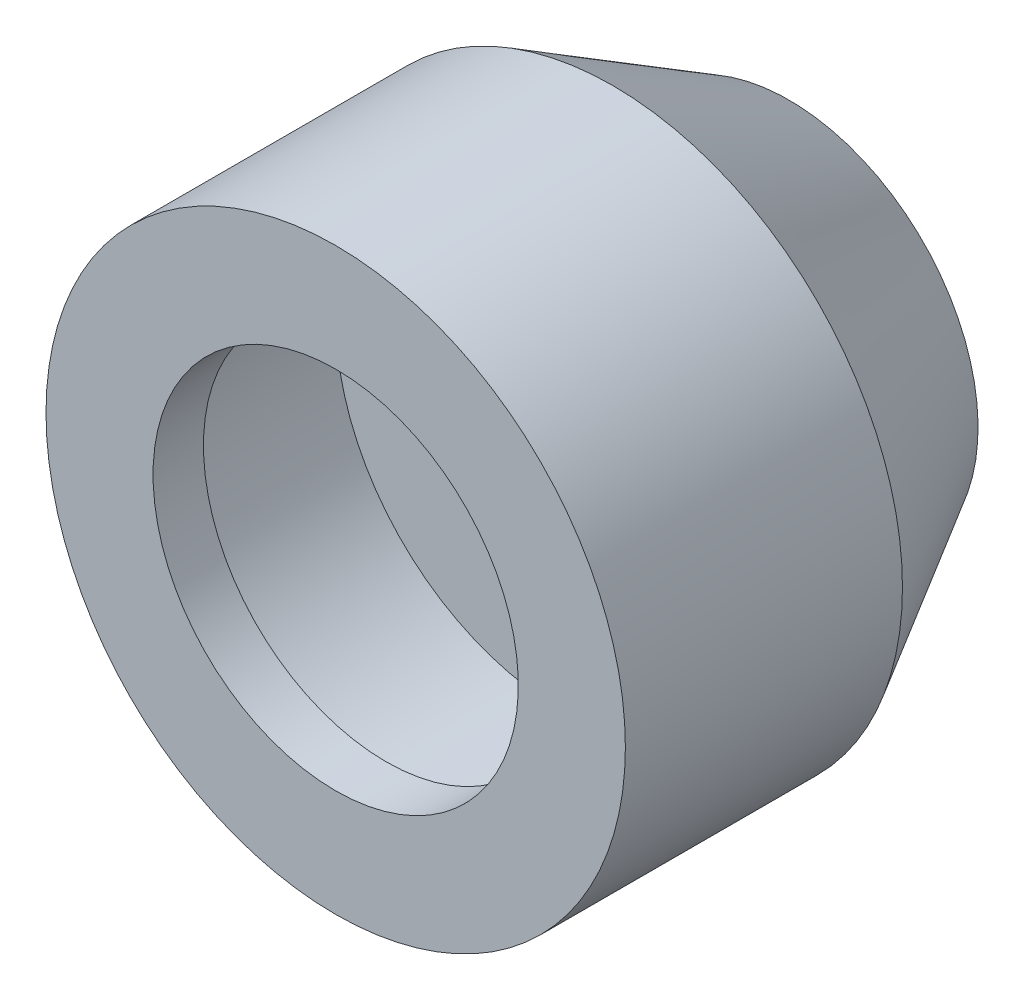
ISO-10303-21;
HEADER;
FILE_DESCRIPTION(('STEP AP214'),'2;1');
FILE_NAME('part.step','',(''),(''),'','','');
FILE_SCHEMA(('AUTOMOTIVE_DESIGN { 1 0 10303 214 1 1 1 1 }'));
ENDSEC;
DATA;
#1=APPLICATION_CONTEXT('core data for automotive mechanical design processes');
#2=APPLICATION_PROTOCOL_DEFINITION('international standard','automotive_design',2000,#1);
#3=PRODUCT_CONTEXT('',#1,'mechanical');
#4=PRODUCT('Part','Part','',(#3));
#5=PRODUCT_RELATED_PRODUCT_CATEGORY('part','',(#4));
#6=PRODUCT_DEFINITION_FORMATION('','',#4);
#7=PRODUCT_DEFINITION_CONTEXT('part definition',#1,'design');
#8=PRODUCT_DEFINITION('design','',#6,#7);
#9=PRODUCT_DEFINITION_SHAPE('','',#8);
#10=(LENGTH_UNIT() NAMED_UNIT(*) SI_UNIT(.MILLI.,.METRE.));
#11=(NAMED_UNIT(*) PLANE_ANGLE_UNIT() SI_UNIT($,.RADIAN.));
#12=(NAMED_UNIT(*) SI_UNIT($,.STERADIAN.) SOLID_ANGLE_UNIT());
#13=UNCERTAINTY_MEASURE_WITH_UNIT(LENGTH_MEASURE(1.E-05),#10,'distance_accuracy_value','');
#14=(GEOMETRIC_REPRESENTATION_CONTEXT(3) GLOBAL_UNCERTAINTY_ASSIGNED_CONTEXT((#13)) GLOBAL_UNIT_ASSIGNED_CONTEXT((#10,
#11,#12)) REPRESENTATION_CONTEXT('',''));
#15=CARTESIAN_POINT('',(0.,0.,0.));
#16=DIRECTION('',(0.,0.,1.));
#17=DIRECTION('',(1.,0.,0.));
#18=AXIS2_PLACEMENT_3D('',#15,#16,#17);
#19=CARTESIAN_POINT('',(0.,0.,9.));
#20=DIRECTION('',(0.,0.,1.));
#21=DIRECTION('',(0.,-1.,0.));
#22=AXIS2_PLACEMENT_3D('',#19,#20,#21);
#23=PLANE('',#22);
#24=CARTESIAN_POINT('',(0.,0.,9.));
#25=DIRECTION('',(0.,0.,1.));
#26=DIRECTION('',(0.,-1.,0.));
#27=AXIS2_PLACEMENT_3D('',#24,#25,#26);
#28=CIRCLE('',#27,9.);
#29=CARTESIAN_POINT('',(0.,-9.,9.));
#30=VERTEX_POINT('',#29);
#31=EDGE_CURVE('E8',#30,#30,#28,.T.);
#32=ORIENTED_EDGE('',*,*,#31,.T.);
#33=EDGE_LOOP('',(#32));
#34=FACE_BOUND('',#33,.T.);
#35=ADVANCED_FACE('F12',(#34),#23,.T.);
#36=CARTESIAN_POINT('',(0.,0.,0.));
#37=DIRECTION('',(0.,0.,1.));
#38=DIRECTION('',(0.,-1.,0.));
#39=AXIS2_PLACEMENT_3D('',#36,#37,#38);
#40=CYLINDRICAL_SURFACE('',#39,9.);
#41=CARTESIAN_POINT('',(0.,0.,16.));
#42=DIRECTION('',(0.,0.,1.));
#43=DIRECTION('',(0.,-1.,0.));
#44=AXIS2_PLACEMENT_3D('',#41,#42,#43);
#45=CIRCLE('',#44,9.);
#46=CARTESIAN_POINT('',(0.,-9.,16.));
#47=VERTEX_POINT('',#46);
#48=EDGE_CURVE('E18',#47,#47,#45,.T.);
#49=ORIENTED_EDGE('',*,*,#48,.T.);
#50=EDGE_LOOP('',(#49));
#51=FACE_BOUND('',#50,.T.);
#52=ORIENTED_EDGE('',*,*,#31,.F.);
#53=EDGE_LOOP('',(#52));
#54=FACE_BOUND('',#53,.T.);
#55=ADVANCED_FACE('F55',(#51,#54),#40,.F.);
#56=CARTESIAN_POINT('',(9.,0.,16.));
#57=DIRECTION('',(0.,0.,-1.));
#58=DIRECTION('',(0.,1.,0.));
#59=AXIS2_PLACEMENT_3D('',#56,#57,#58);
#60=PLANE('',#59);
#61=CARTESIAN_POINT('',(0.,0.,16.));
#62=DIRECTION('',(0.,0.,1.));
#63=DIRECTION('',(0.,-1.,0.));
#64=AXIS2_PLACEMENT_3D('',#61,#62,#63);
#65=CIRCLE('',#64,7.25);
#66=CARTESIAN_POINT('',(0.,-7.25,16.));
#67=VERTEX_POINT('',#66);
#68=EDGE_CURVE('E22',#67,#67,#65,.T.);
#69=ORIENTED_EDGE('',*,*,#68,.T.);
#70=EDGE_LOOP('',(#69));
#71=FACE_BOUND('',#70,.T.);
#72=ORIENTED_EDGE('',*,*,#48,.F.);
#73=EDGE_LOOP('',(#72));
#74=FACE_BOUND('',#73,.T.);
#75=ADVANCED_FACE('F60',(#71,#74),#60,.T.);
#76=CARTESIAN_POINT('',(0.,0.,0.));
#77=DIRECTION('',(0.,0.,1.));
#78=DIRECTION('',(0.,-1.,0.));
#79=AXIS2_PLACEMENT_3D('',#76,#77,#78);
#80=CYLINDRICAL_SURFACE('',#79,7.25);
#81=CARTESIAN_POINT('',(0.,0.,18.));
#82=DIRECTION('',(0.,0.,1.));
#83=DIRECTION('',(0.,-1.,0.));
#84=AXIS2_PLACEMENT_3D('',#81,#82,#83);
#85=CIRCLE('',#84,7.25);
#86=CARTESIAN_POINT('',(0.,-7.25,18.));
#87=VERTEX_POINT('',#86);
#88=EDGE_CURVE('E26',#87,#87,#85,.T.);
#89=ORIENTED_EDGE('',*,*,#88,.T.);
#90=EDGE_LOOP('',(#89));
#91=FACE_BOUND('',#90,.T.);
#92=ORIENTED_EDGE('',*,*,#68,.F.);
#93=EDGE_LOOP('',(#92));
#94=FACE_BOUND('',#93,.T.);
#95=ADVANCED_FACE('F65',(#91,#94),#80,.F.);
#96=CARTESIAN_POINT('',(7.25,0.,18.));
#97=DIRECTION('',(0.,0.,1.));
#98=DIRECTION('',(0.,-1.,0.));
#99=AXIS2_PLACEMENT_3D('',#96,#97,#98);
#100=PLANE('',#99);
#101=CARTESIAN_POINT('',(0.,0.,18.));
#102=DIRECTION('',(0.,0.,1.));
#103=DIRECTION('',(0.,-1.,0.));
#104=AXIS2_PLACEMENT_3D('',#101,#102,#103);
#105=CIRCLE('',#104,11.5);
#106=CARTESIAN_POINT('',(0.,-11.5,18.));
#107=VERTEX_POINT('',#106);
#108=EDGE_CURVE('E31',#107,#107,#105,.T.);
#109=ORIENTED_EDGE('',*,*,#108,.T.);
#110=EDGE_LOOP('',(#109));
#111=FACE_BOUND('',#110,.T.);
#112=ORIENTED_EDGE('',*,*,#88,.F.);
#113=EDGE_LOOP('',(#112));
#114=FACE_BOUND('',#113,.T.);
#115=ADVANCED_FACE('F72',(#111,#114),#100,.T.);
#116=CARTESIAN_POINT('',(0.,0.,0.));
#117=DIRECTION('',(0.,0.,1.));
#118=DIRECTION('',(0.,-1.,0.));
#119=AXIS2_PLACEMENT_3D('',#116,#117,#118);
#120=CYLINDRICAL_SURFACE('',#119,11.5);
#121=CARTESIAN_POINT('',(0.,0.,7.));
#122=DIRECTION('',(0.,0.,1.));
#123=DIRECTION('',(0.,-1.,0.));
#124=AXIS2_PLACEMENT_3D('',#121,#122,#123);
#125=CIRCLE('',#124,11.5);
#126=CARTESIAN_POINT('',(0.,-11.5,7.));
#127=VERTEX_POINT('',#126);
#128=EDGE_CURVE('E34',#127,#127,#125,.T.);
#129=ORIENTED_EDGE('',*,*,#128,.T.);
#130=EDGE_LOOP('',(#129));
#131=FACE_BOUND('',#130,.T.);
#132=ORIENTED_EDGE('',*,*,#108,.F.);
#133=EDGE_LOOP('',(#132));
#134=FACE_BOUND('',#133,.T.);
#135=ADVANCED_FACE('F52',(#131,#134),#120,.T.);
#136=CARTESIAN_POINT('',(0.,0.,7.));
#137=DIRECTION('',(0.,0.,1.));
#138=DIRECTION('',(0.,-1.,0.));
#139=AXIS2_PLACEMENT_3D('',#136,#137,#138);
#140=CONICAL_SURFACE('',#139,11.5,0.519146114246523);
#141=CARTESIAN_POINT('',(0.,0.,0.));
#142=DIRECTION('',(0.,0.,1.));
#143=DIRECTION('',(0.,-1.,0.));
#144=AXIS2_PLACEMENT_3D('',#141,#142,#143);
#145=CIRCLE('',#144,7.5);
#146=CARTESIAN_POINT('',(0.,-7.5,0.));
#147=VERTEX_POINT('',#146);
#148=EDGE_CURVE('E37',#147,#147,#145,.T.);
#149=ORIENTED_EDGE('',*,*,#148,.T.);
#150=EDGE_LOOP('',(#149));
#151=FACE_BOUND('',#150,.T.);
#152=ORIENTED_EDGE('',*,*,#128,.F.);
#153=EDGE_LOOP('',(#152));
#154=FACE_BOUND('',#153,.T.);
#155=ADVANCED_FACE('F41',(#151,#154),#140,.T.);
#156=CARTESIAN_POINT('',(7.5,0.,0.));
#157=DIRECTION('',(0.,0.,-1.));
#158=DIRECTION('',(0.,1.,0.));
#159=AXIS2_PLACEMENT_3D('',#156,#157,#158);
#160=PLANE('',#159);
#161=ORIENTED_EDGE('',*,*,#148,.F.);
#162=EDGE_LOOP('',(#161));
#163=FACE_BOUND('',#162,.T.);
#164=ADVANCED_FACE('F44',(#163),#160,.T.);
#165=CLOSED_SHELL('',(#35,#55,#75,#95,#115,#135,#155,#164));
#166=MANIFOLD_SOLID_BREP('B1',#165);
#167=ADVANCED_BREP_SHAPE_REPRESENTATION('',(#18,#166),#14);
#168=SHAPE_DEFINITION_REPRESENTATION(#9,#167);
ENDSEC;
END-ISO-10303-21;
